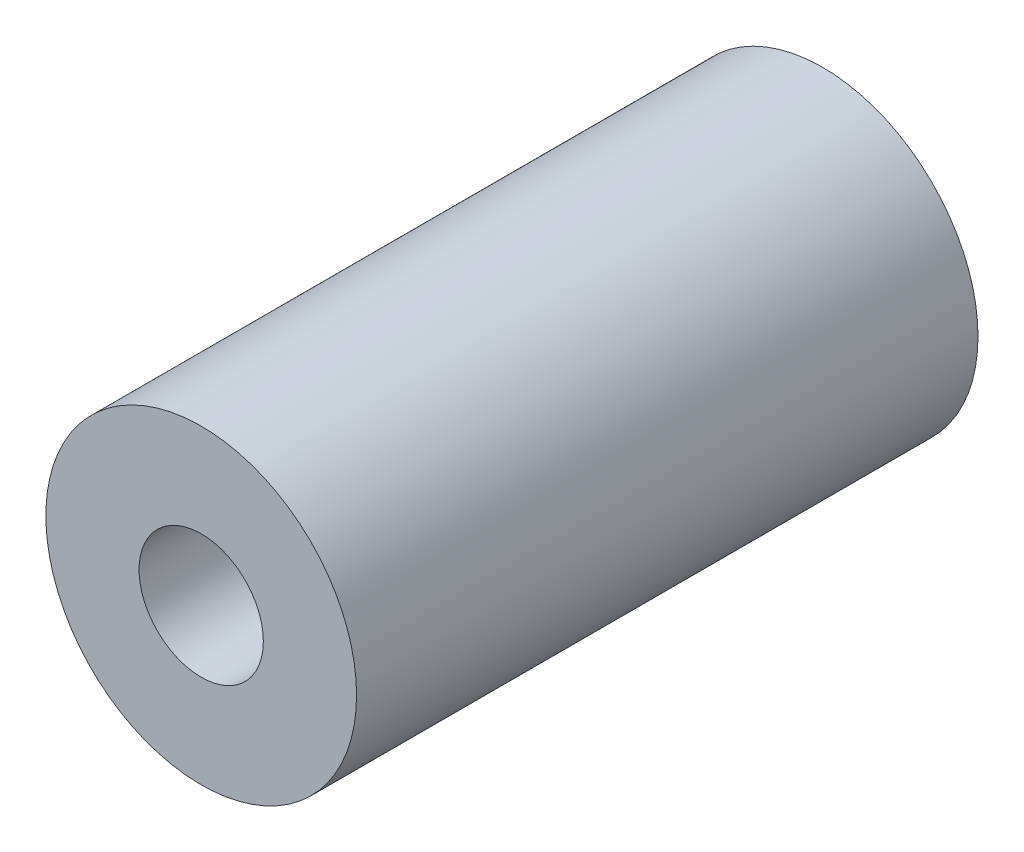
ISO-10303-21;
HEADER;
FILE_DESCRIPTION(('STEP AP214'),'2;1');
FILE_NAME('part.step','',(''),(''),'','','');
FILE_SCHEMA(('AUTOMOTIVE_DESIGN { 1 0 10303 214 1 1 1 1 }'));
ENDSEC;
DATA;
#1=APPLICATION_CONTEXT('core data for automotive mechanical design processes');
#2=APPLICATION_PROTOCOL_DEFINITION('international standard','automotive_design',2000,#1);
#3=PRODUCT_CONTEXT('',#1,'mechanical');
#4=PRODUCT('Part','Part','',(#3));
#5=PRODUCT_RELATED_PRODUCT_CATEGORY('part','',(#4));
#6=PRODUCT_DEFINITION_FORMATION('','',#4);
#7=PRODUCT_DEFINITION_CONTEXT('part definition',#1,'design');
#8=PRODUCT_DEFINITION('design','',#6,#7);
#9=PRODUCT_DEFINITION_SHAPE('','',#8);
#10=(LENGTH_UNIT() NAMED_UNIT(*) SI_UNIT(.MILLI.,.METRE.));
#11=(NAMED_UNIT(*) PLANE_ANGLE_UNIT() SI_UNIT($,.RADIAN.));
#12=(NAMED_UNIT(*) SI_UNIT($,.STERADIAN.) SOLID_ANGLE_UNIT());
#13=UNCERTAINTY_MEASURE_WITH_UNIT(LENGTH_MEASURE(1.E-05),#10,'distance_accuracy_value','');
#14=(GEOMETRIC_REPRESENTATION_CONTEXT(3) GLOBAL_UNCERTAINTY_ASSIGNED_CONTEXT((#13)) GLOBAL_UNIT_ASSIGNED_CONTEXT((#10,
#11,#12)) REPRESENTATION_CONTEXT('',''));
#15=CARTESIAN_POINT('',(0.,0.,0.));
#16=DIRECTION('',(0.,0.,1.));
#17=DIRECTION('',(1.,0.,0.));
#18=AXIS2_PLACEMENT_3D('',#15,#16,#17);
#19=CARTESIAN_POINT('',(0.,0.,20.));
#20=DIRECTION('',(0.,0.,1.));
#21=DIRECTION('',(1.,0.,0.));
#22=AXIS2_PLACEMENT_3D('',#19,#20,#21);
#23=PLANE('',#22);
#24=CARTESIAN_POINT('',(0.,0.,20.));
#25=DIRECTION('',(0.,0.,1.));
#26=DIRECTION('',(1.,0.,0.));
#27=AXIS2_PLACEMENT_3D('',#24,#25,#26);
#28=CIRCLE('',#27,5.);
#29=CARTESIAN_POINT('',(5.,0.,20.));
#30=VERTEX_POINT('',#29);
#31=EDGE_CURVE('E10',#30,#30,#28,.T.);
#32=ORIENTED_EDGE('',*,*,#31,.T.);
#33=EDGE_LOOP('',(#32));
#34=FACE_BOUND('',#33,.T.);
#35=CARTESIAN_POINT('',(0.,0.,20.));
#36=DIRECTION('',(0.,0.,1.));
#37=DIRECTION('',(1.,0.,0.));
#38=AXIS2_PLACEMENT_3D('',#35,#36,#37);
#39=CIRCLE('',#38,2.);
#40=CARTESIAN_POINT('',(2.,0.,20.));
#41=VERTEX_POINT('',#40);
#42=EDGE_CURVE('E33',#41,#41,#39,.T.);
#43=ORIENTED_EDGE('',*,*,#42,.F.);
#44=EDGE_LOOP('',(#43));
#45=FACE_BOUND('',#44,.T.);
#46=ADVANCED_FACE('F15',(#34,#45),#23,.T.);
#47=CARTESIAN_POINT('',(0.,0.,0.));
#48=DIRECTION('',(0.,0.,1.));
#49=DIRECTION('',(1.,0.,0.));
#50=AXIS2_PLACEMENT_3D('',#47,#48,#49);
#51=PLANE('',#50);
#52=CARTESIAN_POINT('',(0.,0.,0.));
#53=DIRECTION('',(0.,0.,1.));
#54=DIRECTION('',(1.,0.,0.));
#55=AXIS2_PLACEMENT_3D('',#52,#53,#54);
#56=CIRCLE('',#55,5.);
#57=CARTESIAN_POINT('',(5.,0.,0.));
#58=VERTEX_POINT('',#57);
#59=EDGE_CURVE('E28',#58,#58,#56,.T.);
#60=ORIENTED_EDGE('',*,*,#59,.F.);
#61=EDGE_LOOP('',(#60));
#62=FACE_BOUND('',#61,.T.);
#63=CARTESIAN_POINT('',(0.,0.,0.));
#64=DIRECTION('',(0.,0.,1.));
#65=DIRECTION('',(1.,0.,0.));
#66=AXIS2_PLACEMENT_3D('',#63,#64,#65);
#67=CIRCLE('',#66,2.);
#68=CARTESIAN_POINT('',(2.,0.,0.));
#69=VERTEX_POINT('',#68);
#70=EDGE_CURVE('E59',#69,#69,#67,.T.);
#71=ORIENTED_EDGE('',*,*,#70,.T.);
#72=EDGE_LOOP('',(#71));
#73=FACE_BOUND('',#72,.T.);
#74=ADVANCED_FACE('F69',(#62,#73),#51,.F.);
#75=CARTESIAN_POINT('',(0.,0.,20.));
#76=DIRECTION('',(0.,0.,-1.));
#77=DIRECTION('',(-1.,0.,0.));
#78=AXIS2_PLACEMENT_3D('',#75,#76,#77);
#79=CYLINDRICAL_SURFACE('',#78,5.);
#80=CARTESIAN_POINT('',(0.,-5.,6.5));
#81=CARTESIAN_POINT('',(0.0822886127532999,-4.9999992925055,6.49999900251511));
#82=CARTESIAN_POINT('',(0.164587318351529,-4.99794915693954,6.49320613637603));
#83=CARTESIAN_POINT('',(0.326788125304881,-4.98997105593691,6.4662786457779));
#84=CARTESIAN_POINT('',(0.40668950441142,-4.98404193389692,6.44614004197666));
#85=CARTESIAN_POINT('',(0.561732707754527,-4.96895552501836,6.39325398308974));
#86=CARTESIAN_POINT('',(0.636881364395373,-4.95980300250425,6.36052513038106));
#87=CARTESIAN_POINT('',(0.780624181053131,-4.93922109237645,6.28346390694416));
#88=CARTESIAN_POINT('',(0.849217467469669,-4.92779140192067,6.23912999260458));
#89=CARTESIAN_POINT('',(0.979871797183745,-4.90350737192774,6.13877599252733));
#90=CARTESIAN_POINT('',(1.04171807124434,-4.89062383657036,6.08248337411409));
#91=CARTESIAN_POINT('',(1.15524920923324,-4.86505834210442,5.96039077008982));
#92=CARTESIAN_POINT('',(1.20693236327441,-4.85237641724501,5.89458918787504));
#93=CARTESIAN_POINT('',(1.29980037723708,-4.82834113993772,5.75352924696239));
#94=CARTESIAN_POINT('',(1.34072309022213,-4.81702406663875,5.67809153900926));
#95=CARTESIAN_POINT('',(1.4092139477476,-4.79743620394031,5.52101074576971));
#96=CARTESIAN_POINT('',(1.43678529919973,-4.78916468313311,5.43936915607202));
#97=CARTESIAN_POINT('',(1.47701633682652,-4.77690870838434,5.27460973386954));
#98=CARTESIAN_POINT('',(1.49007196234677,-4.77281069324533,5.19159725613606));
#99=CARTESIAN_POINT('',(1.50213730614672,-4.76902789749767,5.02446684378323));
#100=CARTESIAN_POINT('',(1.50115042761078,-4.76934204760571,4.94034918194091));
#101=CARTESIAN_POINT('',(1.48546977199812,-4.77424744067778,4.77661609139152));
#102=CARTESIAN_POINT('',(1.47127205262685,-4.7786838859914,4.69694774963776));
#103=CARTESIAN_POINT('',(1.43037420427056,-4.79108356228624,4.54118021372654));
#104=CARTESIAN_POINT('',(1.40367284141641,-4.79904714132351,4.46508137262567));
#105=CARTESIAN_POINT('',(1.33816026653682,-4.81772733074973,4.31739965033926));
#106=CARTESIAN_POINT('',(1.29918816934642,-4.82848016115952,4.24589291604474));
#107=CARTESIAN_POINT('',(1.21035222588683,-4.85150987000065,4.11026797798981));
#108=CARTESIAN_POINT('',(1.16048574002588,-4.86378711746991,4.04615157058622));
#109=CARTESIAN_POINT('',(1.04881290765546,-4.88911011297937,3.92431380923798));
#110=CARTESIAN_POINT('',(0.986594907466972,-4.90216654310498,3.86697133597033));
#111=CARTESIAN_POINT('',(0.853263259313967,-4.92712244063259,3.76344601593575));
#112=CARTESIAN_POINT('',(0.782149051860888,-4.9390218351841,3.71726387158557));
#113=CARTESIAN_POINT('',(0.632355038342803,-4.9604316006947,3.63714007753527));
#114=CARTESIAN_POINT('',(0.55362774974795,-4.96992543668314,3.60328248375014));
#115=CARTESIAN_POINT('',(0.391245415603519,-4.98533521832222,3.54940040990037));
#116=CARTESIAN_POINT('',(0.307591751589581,-4.99125216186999,3.52937207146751));
#117=CARTESIAN_POINT('',(0.140952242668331,-4.99868364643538,3.50434782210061));
#118=CARTESIAN_POINT('',(0.0580500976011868,-5.0003485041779,3.49883841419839));
#119=CARTESIAN_POINT('',(-0.107499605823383,-4.9995292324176,3.50156915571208));
#120=CARTESIAN_POINT('',(-0.190147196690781,-4.99704565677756,3.50980746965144));
#121=CARTESIAN_POINT('',(-0.350903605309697,-4.98830696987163,3.5393846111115));
#122=CARTESIAN_POINT('',(-0.429072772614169,-4.98213829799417,3.56042338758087));
#123=CARTESIAN_POINT('',(-0.580754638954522,-4.96674347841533,3.6146432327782));
#124=CARTESIAN_POINT('',(-0.654266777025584,-4.95751696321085,3.64782576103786));
#125=CARTESIAN_POINT('',(-0.796437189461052,-4.93669654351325,3.72625316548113));
#126=CARTESIAN_POINT('',(-0.864943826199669,-4.92505280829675,3.77175934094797));
#127=CARTESIAN_POINT('',(-0.993523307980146,-4.90073468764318,3.87322475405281));
#128=CARTESIAN_POINT('',(-1.05359403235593,-4.8880600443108,3.92918661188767));
#129=CARTESIAN_POINT('',(-1.16585744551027,-4.86253171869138,4.05238730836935));
#130=CARTESIAN_POINT('',(-1.21768481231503,-4.84968825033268,4.11996187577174));
#131=CARTESIAN_POINT('',(-1.30928995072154,-4.82576515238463,4.26312793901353));
#132=CARTESIAN_POINT('',(-1.34906803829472,-4.81468547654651,4.33871922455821));
#133=CARTESIAN_POINT('',(-1.41517347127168,-4.79567189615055,4.49553249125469));
#134=CARTESIAN_POINT('',(-1.4415634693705,-4.78772337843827,4.57672618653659));
#135=CARTESIAN_POINT('',(-1.48021730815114,-4.77591594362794,4.74268796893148));
#136=CARTESIAN_POINT('',(-1.49248598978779,-4.772055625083,4.82745482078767));
#137=CARTESIAN_POINT('',(-1.50221984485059,-4.76899972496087,4.99436151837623));
#138=CARTESIAN_POINT('',(-1.5002805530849,-4.76961647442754,5.07646365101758));
#139=CARTESIAN_POINT('',(-1.48307505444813,-4.77499401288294,5.2391141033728));
#140=CARTESIAN_POINT('',(-1.46780938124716,-4.77975463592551,5.31966248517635));
#141=CARTESIAN_POINT('',(-1.42476888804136,-4.79275763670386,5.47594539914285));
#142=CARTESIAN_POINT('',(-1.39715175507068,-4.80095604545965,5.55172728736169));
#143=CARTESIAN_POINT('',(-1.33031507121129,-4.81990278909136,5.69764243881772));
#144=CARTESIAN_POINT('',(-1.29109329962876,-4.83065161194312,5.76777461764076));
#145=CARTESIAN_POINT('',(-1.20048763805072,-4.85397676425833,5.90316311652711));
#146=CARTESIAN_POINT('',(-1.14871276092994,-4.86660540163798,5.96814876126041));
#147=CARTESIAN_POINT('',(-1.03517434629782,-4.89201320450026,6.08870249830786));
#148=CARTESIAN_POINT('',(-0.973408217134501,-4.90479240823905,6.14426813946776));
#149=CARTESIAN_POINT('',(-0.839465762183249,-4.92950936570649,6.24602341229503));
#150=CARTESIAN_POINT('',(-0.767037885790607,-4.94141159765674,6.29189144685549));
#151=CARTESIAN_POINT('',(-0.615141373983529,-4.96260680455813,6.37073516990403));
#152=CARTESIAN_POINT('',(-0.535676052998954,-4.97190099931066,6.40371688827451));
#153=CARTESIAN_POINT('',(-0.380757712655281,-4.98602174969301,6.45289527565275));
#154=CARTESIAN_POINT('',(-0.305786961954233,-4.99122027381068,6.47051167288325));
#155=CARTESIAN_POINT('',(-0.153880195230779,-4.99820944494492,6.49406352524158));
#156=CARTESIAN_POINT('',(-0.0769445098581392,-5.0000006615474,6.50000093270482));
#157=CARTESIAN_POINT('',(0.,-5.,6.5));
#158=B_SPLINE_CURVE_WITH_KNOTS('',3,(#80,#81,#82,#83,#84,#85,#86,#87,#88,#89,#90,#91,#92,#93,
#94,#95,#96,#97,#98,#99,#100,#101,#102,#103,#104,#105,#106,#107,#108,#109,#110,#111,#112,#113,
#114,#115,#116,#117,#118,#119,#120,#121,#122,#123,#124,#125,#126,#127,#128,#129,#130,#131,#132,
#133,#134,#135,#136,#137,#138,#139,#140,#141,#142,#143,#144,#145,#146,#147,#148,#149,#150,#151,
#152,#153,#154,#155,#156,#157),.UNSPECIFIED.,.T.,.F.,(4,2,2,2,2,2,2,2,2,2,2,2,2,2,2,2,2,2,2,2,2,
2,2,2,2,2,2,2,2,2,2,2,2,2,2,2,2,2,4),(0.,0.24658320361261,0.493239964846,0.739533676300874,
0.985860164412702,1.23855602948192,1.49129437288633,1.74971481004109,2.00807314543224,
2.25919689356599,2.51025978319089,2.75226016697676,2.99428443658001,3.2396242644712,
3.48502360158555,3.74067104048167,3.99633456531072,4.25371046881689,4.51101453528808,
4.75908809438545,5.00712853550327,5.24956746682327,5.49203554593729,5.74011305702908,
5.98825282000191,6.24540400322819,6.50254844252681,6.75847814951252,7.01432009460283,
7.25950155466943,7.504673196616,7.74680040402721,7.98897397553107,8.23996925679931,
8.49102974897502,8.74942996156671,9.00770911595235,9.2383169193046,9.46888616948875),.UNSPECIFIED.);
#159=CARTESIAN_POINT('',(0.,-5.,6.5));
#160=VERTEX_POINT('',#159);
#161=EDGE_CURVE('E42',#160,#160,#158,.T.);
#162=ORIENTED_EDGE('',*,*,#161,.T.);
#163=EDGE_LOOP('',(#162));
#164=FACE_BOUND('',#163,.T.);
#165=CARTESIAN_POINT('',(0.,-5.,16.5));
#166=CARTESIAN_POINT('',(0.0822886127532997,-4.9999992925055,16.4999990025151));
#167=CARTESIAN_POINT('',(0.164587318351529,-4.99794915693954,16.493206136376));
#168=CARTESIAN_POINT('',(0.32678812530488,-4.98997105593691,16.4662786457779));
#169=CARTESIAN_POINT('',(0.406689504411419,-4.98404193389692,16.4461400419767));
#170=CARTESIAN_POINT('',(0.561732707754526,-4.96895552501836,16.3932539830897));
#171=CARTESIAN_POINT('',(0.636881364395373,-4.95980300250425,16.3605251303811));
#172=CARTESIAN_POINT('',(0.780624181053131,-4.93922109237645,16.2834639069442));
#173=CARTESIAN_POINT('',(0.849217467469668,-4.92779140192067,16.2391299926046));
#174=CARTESIAN_POINT('',(0.979871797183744,-4.90350737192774,16.1387759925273));
#175=CARTESIAN_POINT('',(1.04171807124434,-4.89062383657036,16.0824833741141));
#176=CARTESIAN_POINT('',(1.15524920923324,-4.86505834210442,15.9603907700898));
#177=CARTESIAN_POINT('',(1.20693236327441,-4.85237641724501,15.894589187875));
#178=CARTESIAN_POINT('',(1.29980037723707,-4.82834113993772,15.7535292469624));
#179=CARTESIAN_POINT('',(1.34072309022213,-4.81702406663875,15.6780915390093));
#180=CARTESIAN_POINT('',(1.4092139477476,-4.79743620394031,15.5210107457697));
#181=CARTESIAN_POINT('',(1.43678529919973,-4.78916468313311,15.439369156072));
#182=CARTESIAN_POINT('',(1.47701633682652,-4.77690870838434,15.2746097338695));
#183=CARTESIAN_POINT('',(1.49007196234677,-4.77281069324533,15.1915972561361));
#184=CARTESIAN_POINT('',(1.50213730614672,-4.76902789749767,15.0244668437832));
#185=CARTESIAN_POINT('',(1.50115042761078,-4.76934204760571,14.9403491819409));
#186=CARTESIAN_POINT('',(1.48546977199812,-4.77424744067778,14.7766160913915));
#187=CARTESIAN_POINT('',(1.47127205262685,-4.7786838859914,14.6969477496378));
#188=CARTESIAN_POINT('',(1.43037420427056,-4.79108356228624,14.5411802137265));
#189=CARTESIAN_POINT('',(1.40367284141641,-4.79904714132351,14.4650813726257));
#190=CARTESIAN_POINT('',(1.33816026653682,-4.81772733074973,14.3173996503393));
#191=CARTESIAN_POINT('',(1.29918816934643,-4.82848016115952,14.2458929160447));
#192=CARTESIAN_POINT('',(1.21035222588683,-4.85150987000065,14.1102679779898));
#193=CARTESIAN_POINT('',(1.16048574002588,-4.86378711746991,14.0461515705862));
#194=CARTESIAN_POINT('',(1.04881290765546,-4.88911011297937,13.924313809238));
#195=CARTESIAN_POINT('',(0.986594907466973,-4.90216654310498,13.8669713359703));
#196=CARTESIAN_POINT('',(0.853263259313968,-4.92712244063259,13.7634460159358));
#197=CARTESIAN_POINT('',(0.782149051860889,-4.9390218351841,13.7172638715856));
#198=CARTESIAN_POINT('',(0.632355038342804,-4.9604316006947,13.6371400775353));
#199=CARTESIAN_POINT('',(0.553627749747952,-4.96992543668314,13.6032824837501));
#200=CARTESIAN_POINT('',(0.391245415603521,-4.98533521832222,13.5494004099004));
#201=CARTESIAN_POINT('',(0.307591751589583,-4.99125216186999,13.5293720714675));
#202=CARTESIAN_POINT('',(0.140952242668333,-4.99868364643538,13.5043478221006));
#203=CARTESIAN_POINT('',(0.0580500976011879,-5.0003485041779,13.4988384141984));
#204=CARTESIAN_POINT('',(-0.107499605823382,-4.9995292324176,13.5015691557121));
#205=CARTESIAN_POINT('',(-0.19014719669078,-4.99704565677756,13.5098074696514));
#206=CARTESIAN_POINT('',(-0.350903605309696,-4.98830696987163,13.5393846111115));
#207=CARTESIAN_POINT('',(-0.429072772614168,-4.98213829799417,13.5604233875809));
#208=CARTESIAN_POINT('',(-0.580754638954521,-4.96674347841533,13.6146432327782));
#209=CARTESIAN_POINT('',(-0.654266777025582,-4.95751696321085,13.6478257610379));
#210=CARTESIAN_POINT('',(-0.796437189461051,-4.93669654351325,13.7262531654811));
#211=CARTESIAN_POINT('',(-0.864943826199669,-4.92505280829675,13.771759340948));
#212=CARTESIAN_POINT('',(-0.993523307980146,-4.90073468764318,13.8732247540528));
#213=CARTESIAN_POINT('',(-1.05359403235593,-4.8880600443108,13.9291866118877));
#214=CARTESIAN_POINT('',(-1.16585744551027,-4.86253171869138,14.0523873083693));
#215=CARTESIAN_POINT('',(-1.21768481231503,-4.84968825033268,14.1199618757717));
#216=CARTESIAN_POINT('',(-1.30928995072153,-4.82576515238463,14.2631279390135));
#217=CARTESIAN_POINT('',(-1.34906803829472,-4.81468547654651,14.3387192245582));
#218=CARTESIAN_POINT('',(-1.41517347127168,-4.79567189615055,14.4955324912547));
#219=CARTESIAN_POINT('',(-1.4415634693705,-4.78772337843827,14.5767261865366));
#220=CARTESIAN_POINT('',(-1.48021730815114,-4.77591594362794,14.7426879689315));
#221=CARTESIAN_POINT('',(-1.49248598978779,-4.772055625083,14.8274548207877));
#222=CARTESIAN_POINT('',(-1.50221984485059,-4.76899972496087,14.9943615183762));
#223=CARTESIAN_POINT('',(-1.5002805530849,-4.76961647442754,15.0764636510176));
#224=CARTESIAN_POINT('',(-1.48307505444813,-4.77499401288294,15.2391141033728));
#225=CARTESIAN_POINT('',(-1.46780938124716,-4.77975463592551,15.3196624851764));
#226=CARTESIAN_POINT('',(-1.42476888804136,-4.79275763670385,15.4759453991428));
#227=CARTESIAN_POINT('',(-1.39715175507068,-4.80095604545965,15.5517272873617));
#228=CARTESIAN_POINT('',(-1.33031507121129,-4.81990278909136,15.6976424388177));
#229=CARTESIAN_POINT('',(-1.29109329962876,-4.83065161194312,15.7677746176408));
#230=CARTESIAN_POINT('',(-1.20048763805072,-4.85397676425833,15.9031631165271));
#231=CARTESIAN_POINT('',(-1.14871276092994,-4.86660540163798,15.9681487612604));
#232=CARTESIAN_POINT('',(-1.03517434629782,-4.89201320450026,16.0887024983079));
#233=CARTESIAN_POINT('',(-0.973408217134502,-4.90479240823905,16.1442681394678));
#234=CARTESIAN_POINT('',(-0.839465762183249,-4.92950936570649,16.246023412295));
#235=CARTESIAN_POINT('',(-0.767037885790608,-4.94141159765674,16.2918914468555));
#236=CARTESIAN_POINT('',(-0.615141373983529,-4.96260680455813,16.370735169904));
#237=CARTESIAN_POINT('',(-0.535676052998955,-4.97190099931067,16.4037168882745));
#238=CARTESIAN_POINT('',(-0.380757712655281,-4.98602174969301,16.4528952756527));
#239=CARTESIAN_POINT('',(-0.305786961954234,-4.99122027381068,16.4705116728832));
#240=CARTESIAN_POINT('',(-0.153880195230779,-4.99820944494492,16.4940635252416));
#241=CARTESIAN_POINT('',(-0.0769445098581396,-5.0000006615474,16.5000009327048));
#242=CARTESIAN_POINT('',(0.,-5.,16.5));
#243=B_SPLINE_CURVE_WITH_KNOTS('',3,(#165,#166,#167,#168,#169,#170,#171,#172,#173,#174,#175,
#176,#177,#178,#179,#180,#181,#182,#183,#184,#185,#186,#187,#188,#189,#190,#191,#192,#193,#194,
#195,#196,#197,#198,#199,#200,#201,#202,#203,#204,#205,#206,#207,#208,#209,#210,#211,#212,#213,
#214,#215,#216,#217,#218,#219,#220,#221,#222,#223,#224,#225,#226,#227,#228,#229,#230,#231,#232,
#233,#234,#235,#236,#237,#238,#239,#240,#241,#242),.UNSPECIFIED.,.T.,.F.,(4,2,2,2,2,2,2,2,2,2,2,
2,2,2,2,2,2,2,2,2,2,2,2,2,2,2,2,2,2,2,2,2,2,2,2,2,2,2,4),(0.,0.24658320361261,0.493239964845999,
0.739533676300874,0.9858601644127,1.23855602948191,1.49129437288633,1.74971481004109,
2.00807314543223,2.25919689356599,2.51025978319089,2.75226016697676,2.99428443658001,
3.23962426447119,3.48502360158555,3.74067104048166,3.99633456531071,4.25371046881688,
4.51101453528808,4.75908809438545,5.00712853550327,5.24956746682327,5.49203554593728,
5.74011305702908,5.98825282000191,6.24540400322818,6.5025484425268,6.75847814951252,
7.01432009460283,7.25950155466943,7.504673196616,7.74680040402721,7.98897397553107,
8.2399692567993,8.49102974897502,8.74942996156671,9.00770911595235,9.23831691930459,
9.46888616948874),.UNSPECIFIED.);
#244=CARTESIAN_POINT('',(0.,-5.,16.5));
#245=VERTEX_POINT('',#244);
#246=EDGE_CURVE('E41',#245,#245,#243,.T.);
#247=ORIENTED_EDGE('',*,*,#246,.T.);
#248=EDGE_LOOP('',(#247));
#249=FACE_BOUND('',#248,.T.);
#250=ORIENTED_EDGE('',*,*,#31,.F.);
#251=EDGE_LOOP('',(#250));
#252=FACE_BOUND('',#251,.T.);
#253=ORIENTED_EDGE('',*,*,#59,.T.);
#254=EDGE_LOOP('',(#253));
#255=FACE_BOUND('',#254,.T.);
#256=ADVANCED_FACE('F17',(#164,#249,#252,#255),#79,.T.);
#257=CARTESIAN_POINT('',(0.,0.,20.));
#258=DIRECTION('',(0.,0.,-1.));
#259=DIRECTION('',(-1.,0.,0.));
#260=AXIS2_PLACEMENT_3D('',#257,#258,#259);
#261=CYLINDRICAL_SURFACE('',#260,2.);
#262=CARTESIAN_POINT('',(0.,-2.,6.5));
#263=CARTESIAN_POINT('',(0.0732207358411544,-1.99999540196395,6.49999520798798));
#264=CARTESIAN_POINT('',(0.146561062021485,-1.99593645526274,6.4945949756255));
#265=CARTESIAN_POINT('',(0.290936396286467,-1.98006607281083,6.47333293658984));
#266=CARTESIAN_POINT('',(0.361965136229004,-1.96823514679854,6.45744482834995));
#267=CARTESIAN_POINT('',(0.499234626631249,-1.9379567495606,6.41628709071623));
#268=CARTESIAN_POINT('',(0.565501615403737,-1.91954951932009,6.39107448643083));
#269=CARTESIAN_POINT('',(0.692422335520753,-1.87750556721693,6.33245765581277));
#270=CARTESIAN_POINT('',(0.753077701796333,-1.85387037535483,6.29905582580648));
#271=CARTESIAN_POINT('',(0.873465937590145,-1.80049544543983,6.22173698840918));
#272=CARTESIAN_POINT('',(0.932593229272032,-1.77039308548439,6.17713267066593));
#273=CARTESIAN_POINT('',(1.04302716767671,-1.70767017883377,6.08050416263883));
#274=CARTESIAN_POINT('',(1.09432148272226,-1.67504578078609,6.02846851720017));
#275=CARTESIAN_POINT('',(1.19837161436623,-1.6027112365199,5.90641704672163));
#276=CARTESIAN_POINT('',(1.24930578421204,-1.56290854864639,5.8348963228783));
#277=CARTESIAN_POINT('',(1.33861998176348,-1.48711444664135,5.68254898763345));
#278=CARTESIAN_POINT('',(1.37701716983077,-1.45111786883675,5.60173530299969));
#279=CARTESIAN_POINT('',(1.42880627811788,-1.39977155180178,5.46049716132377));
#280=CARTESIAN_POINT('',(1.44625674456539,-1.38157751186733,5.40260930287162));
#281=CARTESIAN_POINT('',(1.47420672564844,-1.35171594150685,5.28360726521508));
#282=CARTESIAN_POINT('',(1.48472215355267,-1.34003347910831,5.22250082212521));
#283=CARTESIAN_POINT('',(1.49812822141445,-1.32503759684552,5.09781741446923));
#284=CARTESIAN_POINT('',(1.50094954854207,-1.32180026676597,5.03422319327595));
#285=CARTESIAN_POINT('',(1.49848213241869,-1.32459531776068,4.90738508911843));
#286=CARTESIAN_POINT('',(1.49319048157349,-1.33063102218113,4.84414133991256));
#287=CARTESIAN_POINT('',(1.47597739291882,-1.34967623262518,4.72680865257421));
#288=CARTESIAN_POINT('',(1.46482486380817,-1.36187157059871,4.67246362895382));
#289=CARTESIAN_POINT('',(1.43705671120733,-1.39114192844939,4.56656112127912));
#290=CARTESIAN_POINT('',(1.42043583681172,-1.40822163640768,4.51500637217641));
#291=CARTESIAN_POINT('',(1.37033064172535,-1.45741769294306,4.38374361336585));
#292=CARTESIAN_POINT('',(1.3328014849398,-1.49225649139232,4.30659958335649));
#293=CARTESIAN_POINT('',(1.24618023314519,-1.56533298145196,4.16080347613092));
#294=CARTESIAN_POINT('',(1.19706004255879,-1.60357878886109,4.09217266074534));
#295=CARTESIAN_POINT('',(1.08651604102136,-1.68051672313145,3.96224660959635));
#296=CARTESIAN_POINT('',(1.02481375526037,-1.71919586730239,3.90117939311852));
#297=CARTESIAN_POINT('',(0.890422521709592,-1.79248037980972,3.78973635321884));
#298=CARTESIAN_POINT('',(0.817755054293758,-1.8270934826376,3.73934007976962));
#299=CARTESIAN_POINT('',(0.677902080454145,-1.88279726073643,3.66001920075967));
#300=CARTESIAN_POINT('',(0.612539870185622,-1.90520770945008,3.62881540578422));
#301=CARTESIAN_POINT('',(0.476352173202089,-1.94372904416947,3.57577511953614));
#302=CARTESIAN_POINT('',(0.405530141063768,-1.95984387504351,3.55393276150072));
#303=CARTESIAN_POINT('',(0.25967623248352,-1.98445588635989,3.52074663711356));
#304=CARTESIAN_POINT('',(0.184621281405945,-1.99290592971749,3.50946782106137));
#305=CARTESIAN_POINT('',(0.0332012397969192,-2.00115883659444,3.49845040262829));
#306=CARTESIAN_POINT('',(-0.0431632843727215,-2.00096534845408,3.49870693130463));
#307=CARTESIAN_POINT('',(-0.186804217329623,-1.99242547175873,3.51011086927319));
#308=CARTESIAN_POINT('',(-0.254222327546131,-1.98490086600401,3.52016053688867));
#309=CARTESIAN_POINT('',(-0.386110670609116,-1.96351320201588,3.54897378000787));
#310=CARTESIAN_POINT('',(-0.450580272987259,-1.94964879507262,3.56773920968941));
#311=CARTESIAN_POINT('',(-0.577416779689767,-1.91599830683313,3.6138875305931));
#312=CARTESIAN_POINT('',(-0.639629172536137,-1.89602050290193,3.64155118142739));
#313=CARTESIAN_POINT('',(-0.758518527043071,-1.85166985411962,3.70417245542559));
#314=CARTESIAN_POINT('',(-0.815194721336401,-1.82729640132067,3.73913108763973));
#315=CARTESIAN_POINT('',(-0.931511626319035,-1.77119146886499,3.82178324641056));
#316=CARTESIAN_POINT('',(-0.9900667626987,-1.73891095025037,3.87062853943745));
#317=CARTESIAN_POINT('',(-1.09871974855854,-1.67238952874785,3.97600875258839));
#318=CARTESIAN_POINT('',(-1.14879830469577,-1.63814438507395,4.03256069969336));
#319=CARTESIAN_POINT('',(-1.24877541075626,-1.56369128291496,4.16414988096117));
#320=CARTESIAN_POINT('',(-1.29683043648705,-1.523587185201,4.2406575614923));
#321=CARTESIAN_POINT('',(-1.37923235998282,-1.4494059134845,4.40336007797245));
#322=CARTESIAN_POINT('',(-1.41362000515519,-1.41531099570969,4.48952512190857));
#323=CARTESIAN_POINT('',(-1.45615734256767,-1.37118877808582,4.63541444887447));
#324=CARTESIAN_POINT('',(-1.46931009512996,-1.35695811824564,4.69239112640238));
#325=CARTESIAN_POINT('',(-1.48891522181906,-1.3354205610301,4.80870704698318));
#326=CARTESIAN_POINT('',(-1.4953825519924,-1.32809821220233,4.86804070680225));
#327=CARTESIAN_POINT('',(-1.50115320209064,-1.32157601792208,4.98782907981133));
#328=CARTESIAN_POINT('',(-1.50042015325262,-1.32241740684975,5.04828794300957));
#329=CARTESIAN_POINT('',(-1.49176883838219,-1.33216448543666,5.16805683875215));
#330=CARTESIAN_POINT('',(-1.48384130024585,-1.34108058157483,5.22736528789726));
#331=CARTESIAN_POINT('',(-1.45893841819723,-1.36817348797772,5.3559145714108));
#332=CARTESIAN_POINT('',(-1.44036567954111,-1.38794705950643,5.42449718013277));
#333=CARTESIAN_POINT('',(-1.39469627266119,-1.4338296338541,5.55653484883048));
#334=CARTESIAN_POINT('',(-1.3675780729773,-1.45995460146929,5.61997644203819));
#335=CARTESIAN_POINT('',(-1.29498918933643,-1.52516477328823,5.76252063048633));
#336=CARTESIAN_POINT('',(-1.2464154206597,-1.56560203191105,5.83942158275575));
#337=CARTESIAN_POINT('',(-1.13650718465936,-1.64713510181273,5.98312604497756));
#338=CARTESIAN_POINT('',(-1.07516134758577,-1.68823146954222,6.04992046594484));
#339=CARTESIAN_POINT('',(-0.939627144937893,-1.76728988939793,6.17283184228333));
#340=CARTESIAN_POINT('',(-0.865337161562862,-1.80522333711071,6.22885631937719));
#341=CARTESIAN_POINT('',(-0.705159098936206,-1.87357289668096,6.32722305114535));
#342=CARTESIAN_POINT('',(-0.619299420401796,-1.90400691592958,6.3695979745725));
#343=CARTESIAN_POINT('',(-0.464840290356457,-1.94636704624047,6.42779942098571));
#344=CARTESIAN_POINT('',(-0.398553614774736,-1.96110322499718,6.44776673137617));
#345=CARTESIAN_POINT('',(-0.262841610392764,-1.98383739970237,6.47841790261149));
#346=CARTESIAN_POINT('',(-0.193425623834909,-1.99185421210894,6.48912769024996));
#347=CARTESIAN_POINT('',(-0.102963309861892,-1.99745471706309,6.49660469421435));
#348=CARTESIAN_POINT('',(-0.0824069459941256,-1.9984076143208,6.49787627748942));
#349=CARTESIAN_POINT('',(-0.0412368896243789,-1.99968095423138,6.49957467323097));
#350=CARTESIAN_POINT('',(-0.0206231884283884,-2.00000129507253,6.50000134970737));
#351=CARTESIAN_POINT('',(0.,-2.,6.5));
#352=B_SPLINE_CURVE_WITH_KNOTS('',3,(#262,#263,#264,#265,#266,#267,#268,#269,#270,#271,#272,
#273,#274,#275,#276,#277,#278,#279,#280,#281,#282,#283,#284,#285,#286,#287,#288,#289,#290,#291,
#292,#293,#294,#295,#296,#297,#298,#299,#300,#301,#302,#303,#304,#305,#306,#307,#308,#309,#310,
#311,#312,#313,#314,#315,#316,#317,#318,#319,#320,#321,#322,#323,#324,#325,#326,#327,#328,#329,
#330,#331,#332,#333,#334,#335,#336,#337,#338,#339,#340,#341,#342,#343,#344,#345,#346,#347,#348,
#349,#350,#351),.UNSPECIFIED.,.T.,.F.,(4,2,2,2,2,2,2,2,2,2,2,2,2,2,2,2,2,2,2,2,2,2,2,2,2,2,2,2,
2,2,2,2,2,2,2,2,2,2,2,2,2,2,2,2,4),(0.,0.219571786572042,0.439696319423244,0.658496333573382,
0.877232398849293,1.1162243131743,1.35558868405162,1.64360015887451,1.93121574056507,
2.11999518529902,2.3083399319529,2.49837587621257,2.6884799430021,2.85826890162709,
3.0282213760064,3.3044933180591,3.58144192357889,3.8653588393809,4.14872662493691,
4.37526505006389,4.60166129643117,4.82944058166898,5.05712372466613,5.26191187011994,
5.46674360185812,5.6788043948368,5.89089453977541,6.13840382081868,6.38646908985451,
6.68168596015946,6.97601595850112,7.15589161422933,7.33536399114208,7.51574333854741,
7.69635548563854,7.91639670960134,8.13699685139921,8.43412246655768,8.73151372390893,
9.0313544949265,9.33047220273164,9.5419569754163,9.75284752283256,9.81468166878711,
9.87652576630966),.UNSPECIFIED.);
#353=CARTESIAN_POINT('',(0.,-2.,6.5));
#354=VERTEX_POINT('',#353);
#355=EDGE_CURVE('E20',#354,#354,#352,.T.);
#356=ORIENTED_EDGE('',*,*,#355,.F.);
#357=EDGE_LOOP('',(#356));
#358=FACE_BOUND('',#357,.T.);
#359=CARTESIAN_POINT('',(0.,-2.,16.5));
#360=CARTESIAN_POINT('',(0.0732207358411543,-1.99999540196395,16.499995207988));
#361=CARTESIAN_POINT('',(0.146561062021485,-1.99593645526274,16.4945949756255));
#362=CARTESIAN_POINT('',(0.290936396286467,-1.98006607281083,16.4733329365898));
#363=CARTESIAN_POINT('',(0.361965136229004,-1.96823514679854,16.4574448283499));
#364=CARTESIAN_POINT('',(0.499234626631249,-1.9379567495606,16.4162870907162));
#365=CARTESIAN_POINT('',(0.565501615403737,-1.91954951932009,16.3910744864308));
#366=CARTESIAN_POINT('',(0.692422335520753,-1.87750556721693,16.3324576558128));
#367=CARTESIAN_POINT('',(0.753077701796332,-1.85387037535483,16.2990558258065));
#368=CARTESIAN_POINT('',(0.873465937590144,-1.80049544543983,16.2217369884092));
#369=CARTESIAN_POINT('',(0.932593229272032,-1.77039308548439,16.1771326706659));
#370=CARTESIAN_POINT('',(1.04302716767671,-1.70767017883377,16.0805041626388));
#371=CARTESIAN_POINT('',(1.09432148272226,-1.67504578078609,16.0284685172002));
#372=CARTESIAN_POINT('',(1.19837161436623,-1.6027112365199,15.9064170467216));
#373=CARTESIAN_POINT('',(1.24930578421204,-1.56290854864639,15.8348963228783));
#374=CARTESIAN_POINT('',(1.33861998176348,-1.48711444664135,15.6825489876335));
#375=CARTESIAN_POINT('',(1.37701716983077,-1.45111786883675,15.6017353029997));
#376=CARTESIAN_POINT('',(1.42880627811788,-1.39977155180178,15.4604971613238));
#377=CARTESIAN_POINT('',(1.44625674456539,-1.38157751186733,15.4026093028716));
#378=CARTESIAN_POINT('',(1.47420672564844,-1.35171594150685,15.2836072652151));
#379=CARTESIAN_POINT('',(1.48472215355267,-1.34003347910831,15.2225008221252));
#380=CARTESIAN_POINT('',(1.49812822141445,-1.32503759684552,15.0978174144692));
#381=CARTESIAN_POINT('',(1.50094954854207,-1.32180026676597,15.0342231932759));
#382=CARTESIAN_POINT('',(1.49848213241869,-1.32459531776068,14.9073850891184));
#383=CARTESIAN_POINT('',(1.49319048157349,-1.33063102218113,14.8441413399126));
#384=CARTESIAN_POINT('',(1.47597739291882,-1.34967623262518,14.7268086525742));
#385=CARTESIAN_POINT('',(1.46482486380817,-1.36187157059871,14.6724636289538));
#386=CARTESIAN_POINT('',(1.43705671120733,-1.39114192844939,14.5665611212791));
#387=CARTESIAN_POINT('',(1.42043583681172,-1.40822163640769,14.5150063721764));
#388=CARTESIAN_POINT('',(1.37033064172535,-1.45741769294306,14.3837436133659));
#389=CARTESIAN_POINT('',(1.3328014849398,-1.49225649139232,14.3065995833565));
#390=CARTESIAN_POINT('',(1.24618023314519,-1.56533298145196,14.1608034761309));
#391=CARTESIAN_POINT('',(1.19706004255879,-1.60357878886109,14.0921726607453));
#392=CARTESIAN_POINT('',(1.08651604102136,-1.68051672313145,13.9622466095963));
#393=CARTESIAN_POINT('',(1.02481375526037,-1.71919586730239,13.9011793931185));
#394=CARTESIAN_POINT('',(0.890422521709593,-1.79248037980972,13.7897363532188));
#395=CARTESIAN_POINT('',(0.81775505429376,-1.8270934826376,13.7393400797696));
#396=CARTESIAN_POINT('',(0.677902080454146,-1.88279726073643,13.6600192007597));
#397=CARTESIAN_POINT('',(0.612539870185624,-1.90520770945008,13.6288154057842));
#398=CARTESIAN_POINT('',(0.47635217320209,-1.94372904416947,13.5757751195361));
#399=CARTESIAN_POINT('',(0.40553014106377,-1.95984387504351,13.5539327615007));
#400=CARTESIAN_POINT('',(0.259676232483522,-1.98445588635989,13.5207466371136));
#401=CARTESIAN_POINT('',(0.184621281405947,-1.99290592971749,13.5094678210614));
#402=CARTESIAN_POINT('',(0.033201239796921,-2.00115883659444,13.4984504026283));
#403=CARTESIAN_POINT('',(-0.0431632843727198,-2.00096534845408,13.4987069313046));
#404=CARTESIAN_POINT('',(-0.186804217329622,-1.99242547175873,13.5101108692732));
#405=CARTESIAN_POINT('',(-0.25422232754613,-1.98490086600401,13.5201605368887));
#406=CARTESIAN_POINT('',(-0.386110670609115,-1.96351320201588,13.5489737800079));
#407=CARTESIAN_POINT('',(-0.450580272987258,-1.94964879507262,13.5677392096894));
#408=CARTESIAN_POINT('',(-0.577416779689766,-1.91599830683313,13.6138875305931));
#409=CARTESIAN_POINT('',(-0.639629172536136,-1.89602050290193,13.6415511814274));
#410=CARTESIAN_POINT('',(-0.75851852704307,-1.85166985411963,13.7041724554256));
#411=CARTESIAN_POINT('',(-0.8151947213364,-1.82729640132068,13.7391310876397));
#412=CARTESIAN_POINT('',(-0.931511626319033,-1.77119146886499,13.8217832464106));
#413=CARTESIAN_POINT('',(-0.990066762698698,-1.73891095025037,13.8706285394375));
#414=CARTESIAN_POINT('',(-1.09871974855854,-1.67238952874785,13.9760087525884));
#415=CARTESIAN_POINT('',(-1.14879830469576,-1.63814438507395,14.0325606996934));
#416=CARTESIAN_POINT('',(-1.24877541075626,-1.56369128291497,14.1641498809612));
#417=CARTESIAN_POINT('',(-1.29683043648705,-1.523587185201,14.2406575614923));
#418=CARTESIAN_POINT('',(-1.37923235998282,-1.4494059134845,14.4033600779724));
#419=CARTESIAN_POINT('',(-1.41362000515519,-1.41531099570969,14.4895251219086));
#420=CARTESIAN_POINT('',(-1.45615734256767,-1.37118877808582,14.6354144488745));
#421=CARTESIAN_POINT('',(-1.46931009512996,-1.35695811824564,14.6923911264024));
#422=CARTESIAN_POINT('',(-1.48891522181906,-1.3354205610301,14.8087070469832));
#423=CARTESIAN_POINT('',(-1.4953825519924,-1.32809821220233,14.8680407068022));
#424=CARTESIAN_POINT('',(-1.50115320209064,-1.32157601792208,14.9878290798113));
#425=CARTESIAN_POINT('',(-1.50042015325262,-1.32241740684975,15.0482879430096));
#426=CARTESIAN_POINT('',(-1.49176883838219,-1.33216448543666,15.1680568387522));
#427=CARTESIAN_POINT('',(-1.48384130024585,-1.34108058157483,15.2273652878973));
#428=CARTESIAN_POINT('',(-1.45893841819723,-1.36817348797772,15.3559145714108));
#429=CARTESIAN_POINT('',(-1.44036567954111,-1.38794705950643,15.4244971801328));
#430=CARTESIAN_POINT('',(-1.39469627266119,-1.4338296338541,15.5565348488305));
#431=CARTESIAN_POINT('',(-1.3675780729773,-1.45995460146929,15.6199764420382));
#432=CARTESIAN_POINT('',(-1.29498918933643,-1.52516477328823,15.7625206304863));
#433=CARTESIAN_POINT('',(-1.24641542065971,-1.56560203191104,15.8394215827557));
#434=CARTESIAN_POINT('',(-1.13650718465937,-1.64713510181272,15.9831260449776));
#435=CARTESIAN_POINT('',(-1.07516134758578,-1.68823146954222,16.0499204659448));
#436=CARTESIAN_POINT('',(-0.939627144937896,-1.76728988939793,16.1728318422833));
#437=CARTESIAN_POINT('',(-0.865337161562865,-1.80522333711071,16.2288563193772));
#438=CARTESIAN_POINT('',(-0.705159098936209,-1.87357289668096,16.3272230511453));
#439=CARTESIAN_POINT('',(-0.6192994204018,-1.90400691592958,16.3695979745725));
#440=CARTESIAN_POINT('',(-0.464840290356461,-1.94636704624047,16.4277994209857));
#441=CARTESIAN_POINT('',(-0.398553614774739,-1.96110322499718,16.4477667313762));
#442=CARTESIAN_POINT('',(-0.262841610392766,-1.98383739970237,16.4784179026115));
#443=CARTESIAN_POINT('',(-0.193425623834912,-1.99185421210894,16.48912769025));
#444=CARTESIAN_POINT('',(-0.102963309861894,-1.99745471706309,16.4966046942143));
#445=CARTESIAN_POINT('',(-0.0824069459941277,-1.9984076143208,16.4978762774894));
#446=CARTESIAN_POINT('',(-0.0412368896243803,-1.99968095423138,16.499574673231));
#447=CARTESIAN_POINT('',(-0.0206231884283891,-2.00000129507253,16.5000013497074));
#448=CARTESIAN_POINT('',(0.,-2.,16.5));
#449=B_SPLINE_CURVE_WITH_KNOTS('',3,(#359,#360,#361,#362,#363,#364,#365,#366,#367,#368,#369,
#370,#371,#372,#373,#374,#375,#376,#377,#378,#379,#380,#381,#382,#383,#384,#385,#386,#387,#388,
#389,#390,#391,#392,#393,#394,#395,#396,#397,#398,#399,#400,#401,#402,#403,#404,#405,#406,#407,
#408,#409,#410,#411,#412,#413,#414,#415,#416,#417,#418,#419,#420,#421,#422,#423,#424,#425,#426,
#427,#428,#429,#430,#431,#432,#433,#434,#435,#436,#437,#438,#439,#440,#441,#442,#443,#444,#445,
#446,#447,#448),.UNSPECIFIED.,.T.,.F.,(4,2,2,2,2,2,2,2,2,2,2,2,2,2,2,2,2,2,2,2,2,2,2,2,2,2,2,2,
2,2,2,2,2,2,2,2,2,2,2,2,2,2,2,2,4),(0.,0.219571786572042,0.439696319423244,0.658496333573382,
0.877232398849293,1.1162243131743,1.35558868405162,1.64360015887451,1.93121574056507,
2.11999518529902,2.3083399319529,2.49837587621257,2.6884799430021,2.85826890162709,
3.02822137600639,3.30449331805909,3.58144192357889,3.8653588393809,4.1487266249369,
4.37526505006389,4.60166129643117,4.82944058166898,5.05712372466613,5.26191187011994,
5.46674360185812,5.67880439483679,5.89089453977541,6.13840382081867,6.38646908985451,
6.68168596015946,6.97601595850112,7.15589161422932,7.33536399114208,7.51574333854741,
7.69635548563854,7.91639670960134,8.13699685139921,8.43412246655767,8.73151372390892,
9.03135449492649,9.33047220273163,9.54195697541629,9.75284752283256,9.8146816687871,
9.87652576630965),.UNSPECIFIED.);
#450=CARTESIAN_POINT('',(0.,-2.,16.5));
#451=VERTEX_POINT('',#450);
#452=EDGE_CURVE('E36',#451,#451,#449,.T.);
#453=ORIENTED_EDGE('',*,*,#452,.F.);
#454=EDGE_LOOP('',(#453));
#455=FACE_BOUND('',#454,.T.);
#456=ORIENTED_EDGE('',*,*,#42,.T.);
#457=EDGE_LOOP('',(#456));
#458=FACE_BOUND('',#457,.T.);
#459=ORIENTED_EDGE('',*,*,#70,.F.);
#460=EDGE_LOOP('',(#459));
#461=FACE_BOUND('',#460,.T.);
#462=ADVANCED_FACE('F43',(#358,#455,#458,#461),#261,.F.);
#463=CARTESIAN_POINT('',(0.,-20.,15.));
#464=DIRECTION('',(0.,1.,0.));
#465=DIRECTION('',(0.,0.,1.));
#466=AXIS2_PLACEMENT_3D('',#463,#464,#465);
#467=CYLINDRICAL_SURFACE('',#466,1.5);
#468=ORIENTED_EDGE('',*,*,#452,.T.);
#469=EDGE_LOOP('',(#468));
#470=FACE_BOUND('',#469,.T.);
#471=ORIENTED_EDGE('',*,*,#246,.F.);
#472=EDGE_LOOP('',(#471));
#473=FACE_BOUND('',#472,.T.);
#474=ADVANCED_FACE('F46',(#470,#473),#467,.F.);
#475=CARTESIAN_POINT('',(0.,-20.,5.));
#476=DIRECTION('',(0.,1.,0.));
#477=DIRECTION('',(0.,0.,1.));
#478=AXIS2_PLACEMENT_3D('',#475,#476,#477);
#479=CYLINDRICAL_SURFACE('',#478,1.5);
#480=ORIENTED_EDGE('',*,*,#355,.T.);
#481=EDGE_LOOP('',(#480));
#482=FACE_BOUND('',#481,.T.);
#483=ORIENTED_EDGE('',*,*,#161,.F.);
#484=EDGE_LOOP('',(#483));
#485=FACE_BOUND('',#484,.T.);
#486=ADVANCED_FACE('F49',(#482,#485),#479,.F.);
#487=CLOSED_SHELL('',(#46,#74,#256,#462,#474,#486));
#488=MANIFOLD_SOLID_BREP('B1',#487);
#489=ADVANCED_BREP_SHAPE_REPRESENTATION('',(#18,#488),#14);
#490=SHAPE_DEFINITION_REPRESENTATION(#9,#489);
ENDSEC;
END-ISO-10303-21;
